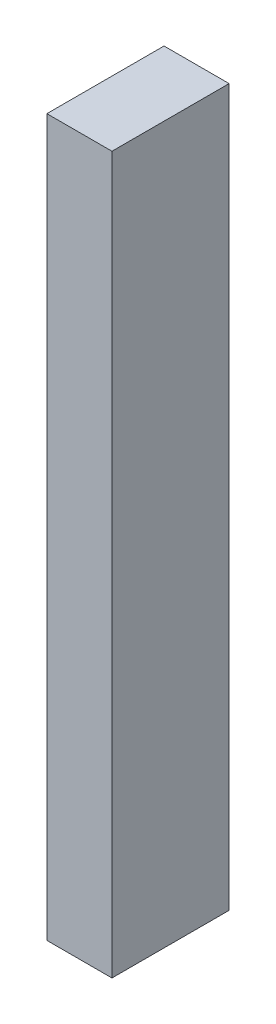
from build123d import *

# Parameters (mm, degrees)
ESQUISSE1_W      = 10
ESQUISSE1_H      = 110
EXTRUSION1_DEPTH = 18


with BuildPart() as part:
    # Esquisse1 → Extrusion1 (new body)
    with BuildSketch(Plane.XY):
        with Locations((5, 55)):
            Rectangle(ESQUISSE1_W, ESQUISSE1_H)
    extrude(amount=-EXTRUSION1_DEPTH)


solid = part.part
